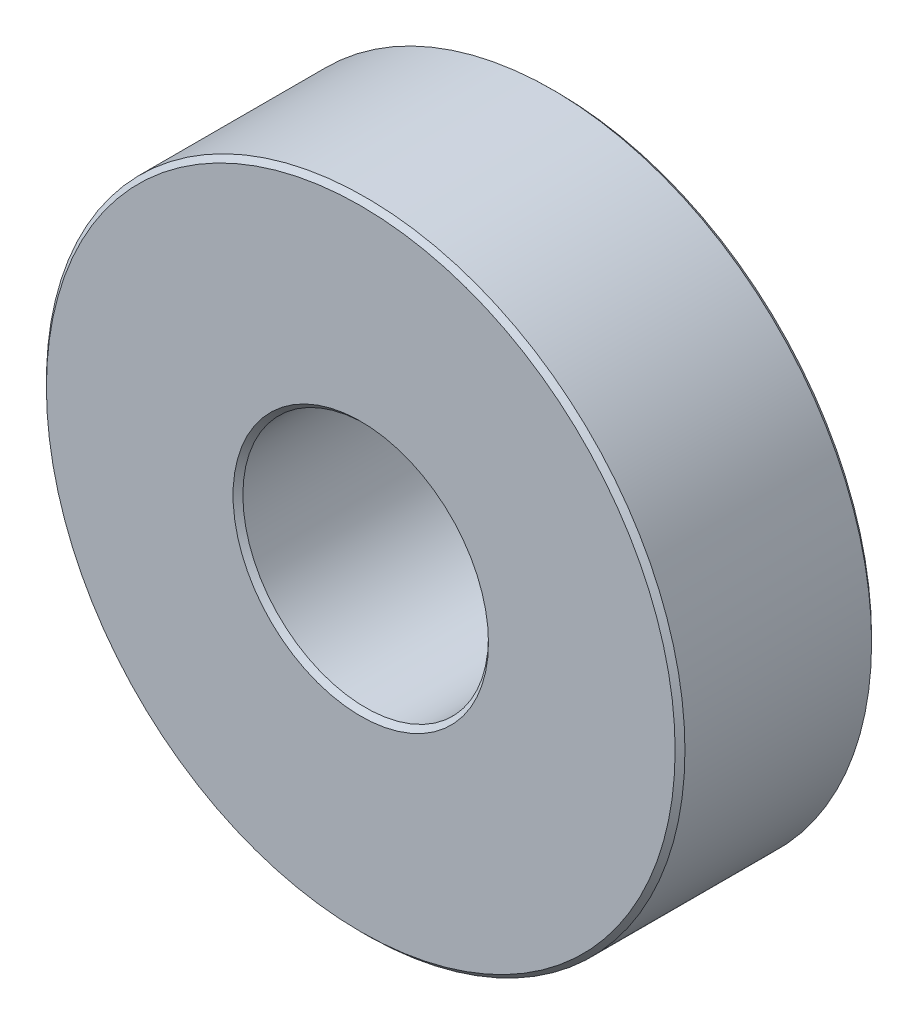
ISO-10303-21;
HEADER;
FILE_DESCRIPTION(('STEP AP214'),'2;1');
FILE_NAME('part.step','',(''),(''),'','','');
FILE_SCHEMA(('AUTOMOTIVE_DESIGN { 1 0 10303 214 1 1 1 1 }'));
ENDSEC;
DATA;
#1=APPLICATION_CONTEXT('core data for automotive mechanical design processes');
#2=APPLICATION_PROTOCOL_DEFINITION('international standard','automotive_design',2000,#1);
#3=PRODUCT_CONTEXT('',#1,'mechanical');
#4=PRODUCT('Part','Part','',(#3));
#5=PRODUCT_RELATED_PRODUCT_CATEGORY('part','',(#4));
#6=PRODUCT_DEFINITION_FORMATION('','',#4);
#7=PRODUCT_DEFINITION_CONTEXT('part definition',#1,'design');
#8=PRODUCT_DEFINITION('design','',#6,#7);
#9=PRODUCT_DEFINITION_SHAPE('','',#8);
#10=(LENGTH_UNIT() NAMED_UNIT(*) SI_UNIT(.MILLI.,.METRE.));
#11=(NAMED_UNIT(*) PLANE_ANGLE_UNIT() SI_UNIT($,.RADIAN.));
#12=(NAMED_UNIT(*) SI_UNIT($,.STERADIAN.) SOLID_ANGLE_UNIT());
#13=UNCERTAINTY_MEASURE_WITH_UNIT(LENGTH_MEASURE(1.E-05),#10,'distance_accuracy_value','');
#14=(GEOMETRIC_REPRESENTATION_CONTEXT(3) GLOBAL_UNCERTAINTY_ASSIGNED_CONTEXT((#13)) GLOBAL_UNIT_ASSIGNED_CONTEXT((#10,
#11,#12)) REPRESENTATION_CONTEXT('',''));
#15=CARTESIAN_POINT('',(0.,0.,0.));
#16=DIRECTION('',(0.,0.,1.));
#17=DIRECTION('',(1.,0.,0.));
#18=AXIS2_PLACEMENT_3D('',#15,#16,#17);
#19=CARTESIAN_POINT('',(0.,0.,4.));
#20=DIRECTION('',(0.,0.,-1.));
#21=DIRECTION('',(-1.,0.,0.));
#22=AXIS2_PLACEMENT_3D('',#19,#20,#21);
#23=CYLINDRICAL_SURFACE('',#22,6.5);
#24=CARTESIAN_POINT('',(0.,0.,3.9));
#25=DIRECTION('',(0.,0.,1.));
#26=DIRECTION('',(1.,0.,0.));
#27=AXIS2_PLACEMENT_3D('',#24,#25,#26);
#28=CIRCLE('',#27,6.5);
#29=CARTESIAN_POINT('',(6.5,0.,3.9));
#30=VERTEX_POINT('',#29);
#31=EDGE_CURVE('E45',#30,#30,#28,.F.);
#32=ORIENTED_EDGE('',*,*,#31,.T.);
#33=EDGE_LOOP('',(#32));
#34=FACE_BOUND('',#33,.T.);
#35=CARTESIAN_POINT('',(0.,0.,0.100000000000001));
#36=DIRECTION('',(0.,0.,1.));
#37=DIRECTION('',(1.,0.,0.));
#38=AXIS2_PLACEMENT_3D('',#35,#36,#37);
#39=CIRCLE('',#38,6.5);
#40=CARTESIAN_POINT('',(6.5,0.,0.100000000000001));
#41=VERTEX_POINT('',#40);
#42=EDGE_CURVE('E48',#41,#41,#39,.T.);
#43=ORIENTED_EDGE('',*,*,#42,.T.);
#44=EDGE_LOOP('',(#43));
#45=FACE_BOUND('',#44,.T.);
#46=ADVANCED_FACE('F26',(#34,#45),#23,.T.);
#47=CARTESIAN_POINT('',(0.,0.,4.));
#48=DIRECTION('',(0.,0.,1.));
#49=DIRECTION('',(1.,0.,0.));
#50=AXIS2_PLACEMENT_3D('',#47,#48,#49);
#51=PLANE('',#50);
#52=CARTESIAN_POINT('',(0.,0.,4.));
#53=DIRECTION('',(0.,0.,1.));
#54=DIRECTION('',(1.,0.,0.));
#55=AXIS2_PLACEMENT_3D('',#52,#53,#54);
#56=CIRCLE('',#55,6.4);
#57=CARTESIAN_POINT('',(6.4,0.,4.));
#58=VERTEX_POINT('',#57);
#59=EDGE_CURVE('E51',#58,#58,#56,.T.);
#60=ORIENTED_EDGE('',*,*,#59,.T.);
#61=EDGE_LOOP('',(#60));
#62=FACE_BOUND('',#61,.T.);
#63=CARTESIAN_POINT('',(0.,0.,4.));
#64=DIRECTION('',(0.,0.,1.));
#65=DIRECTION('',(1.,0.,0.));
#66=AXIS2_PLACEMENT_3D('',#63,#64,#65);
#67=CIRCLE('',#66,2.6);
#68=CARTESIAN_POINT('',(2.6,0.,4.));
#69=VERTEX_POINT('',#68);
#70=EDGE_CURVE('E54',#69,#69,#67,.F.);
#71=ORIENTED_EDGE('',*,*,#70,.T.);
#72=EDGE_LOOP('',(#71));
#73=FACE_BOUND('',#72,.T.);
#74=ADVANCED_FACE('F58',(#62,#73),#51,.T.);
#75=CARTESIAN_POINT('',(0.,0.,0.));
#76=DIRECTION('',(0.,0.,1.));
#77=DIRECTION('',(1.,0.,0.));
#78=AXIS2_PLACEMENT_3D('',#75,#76,#77);
#79=PLANE('',#78);
#80=CARTESIAN_POINT('',(0.,0.,0.));
#81=DIRECTION('',(0.,0.,1.));
#82=DIRECTION('',(1.,0.,0.));
#83=AXIS2_PLACEMENT_3D('',#80,#81,#82);
#84=CIRCLE('',#83,6.4);
#85=CARTESIAN_POINT('',(6.4,0.,0.));
#86=VERTEX_POINT('',#85);
#87=EDGE_CURVE('E36',#86,#86,#84,.F.);
#88=ORIENTED_EDGE('',*,*,#87,.T.);
#89=EDGE_LOOP('',(#88));
#90=FACE_BOUND('',#89,.T.);
#91=CARTESIAN_POINT('',(0.,0.,0.));
#92=DIRECTION('',(0.,0.,1.));
#93=DIRECTION('',(1.,0.,0.));
#94=AXIS2_PLACEMENT_3D('',#91,#92,#93);
#95=CIRCLE('',#94,2.6);
#96=CARTESIAN_POINT('',(2.6,0.,0.));
#97=VERTEX_POINT('',#96);
#98=EDGE_CURVE('E40',#97,#97,#95,.T.);
#99=ORIENTED_EDGE('',*,*,#98,.T.);
#100=EDGE_LOOP('',(#99));
#101=FACE_BOUND('',#100,.T.);
#102=ADVANCED_FACE('F80',(#90,#101),#79,.F.);
#103=CARTESIAN_POINT('',(0.,0.,0.));
#104=DIRECTION('',(0.,0.,1.));
#105=DIRECTION('',(1.,0.,0.));
#106=AXIS2_PLACEMENT_3D('',#103,#104,#105);
#107=CYLINDRICAL_SURFACE('',#106,2.5);
#108=CARTESIAN_POINT('',(0.,0.,3.9));
#109=DIRECTION('',(0.,0.,1.));
#110=DIRECTION('',(1.,0.,0.));
#111=AXIS2_PLACEMENT_3D('',#108,#109,#110);
#112=CIRCLE('',#111,2.5);
#113=CARTESIAN_POINT('',(2.5,0.,3.9));
#114=VERTEX_POINT('',#113);
#115=EDGE_CURVE('E10',#114,#114,#112,.T.);
#116=ORIENTED_EDGE('',*,*,#115,.T.);
#117=EDGE_LOOP('',(#116));
#118=FACE_BOUND('',#117,.T.);
#119=CARTESIAN_POINT('',(0.,0.,0.100000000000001));
#120=DIRECTION('',(0.,0.,1.));
#121=DIRECTION('',(1.,0.,0.));
#122=AXIS2_PLACEMENT_3D('',#119,#120,#121);
#123=CIRCLE('',#122,2.5);
#124=CARTESIAN_POINT('',(2.5,0.,0.100000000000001));
#125=VERTEX_POINT('',#124);
#126=EDGE_CURVE('E32',#125,#125,#123,.F.);
#127=ORIENTED_EDGE('',*,*,#126,.T.);
#128=EDGE_LOOP('',(#127));
#129=FACE_BOUND('',#128,.T.);
#130=ADVANCED_FACE('F89',(#118,#129),#107,.F.);
#131=CARTESIAN_POINT('',(0.,0.,4.));
#132=DIRECTION('',(0.,0.,-1.));
#133=DIRECTION('',(-1.,0.,0.));
#134=AXIS2_PLACEMENT_3D('',#131,#132,#133);
#135=CONICAL_SURFACE('',#134,6.4,0.785398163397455);
#136=ORIENTED_EDGE('',*,*,#31,.F.);
#137=EDGE_LOOP('',(#136));
#138=FACE_BOUND('',#137,.T.);
#139=ORIENTED_EDGE('',*,*,#59,.F.);
#140=EDGE_LOOP('',(#139));
#141=FACE_BOUND('',#140,.T.);
#142=ADVANCED_FACE('F72',(#138,#141),#135,.T.);
#143=CARTESIAN_POINT('',(0.,0.,0.100000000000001));
#144=DIRECTION('',(0.,0.,1.));
#145=DIRECTION('',(1.,0.,0.));
#146=AXIS2_PLACEMENT_3D('',#143,#144,#145);
#147=CONICAL_SURFACE('',#146,6.5,0.785398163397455);
#148=ORIENTED_EDGE('',*,*,#87,.F.);
#149=EDGE_LOOP('',(#148));
#150=FACE_BOUND('',#149,.T.);
#151=ORIENTED_EDGE('',*,*,#42,.F.);
#152=EDGE_LOOP('',(#151));
#153=FACE_BOUND('',#152,.T.);
#154=ADVANCED_FACE('F64',(#150,#153),#147,.T.);
#155=CARTESIAN_POINT('',(0.,0.,3.9));
#156=DIRECTION('',(0.,0.,1.));
#157=DIRECTION('',(1.,0.,0.));
#158=AXIS2_PLACEMENT_3D('',#155,#156,#157);
#159=CONICAL_SURFACE('',#158,2.5,0.785398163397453);
#160=ORIENTED_EDGE('',*,*,#70,.F.);
#161=EDGE_LOOP('',(#160));
#162=FACE_BOUND('',#161,.T.);
#163=ORIENTED_EDGE('',*,*,#115,.F.);
#164=EDGE_LOOP('',(#163));
#165=FACE_BOUND('',#164,.T.);
#166=ADVANCED_FACE('F60',(#162,#165),#159,.F.);
#167=CARTESIAN_POINT('',(0.,0.,0.));
#168=DIRECTION('',(0.,0.,-1.));
#169=DIRECTION('',(-1.,0.,0.));
#170=AXIS2_PLACEMENT_3D('',#167,#168,#169);
#171=CONICAL_SURFACE('',#170,2.6,0.785398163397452);
#172=ORIENTED_EDGE('',*,*,#126,.F.);
#173=EDGE_LOOP('',(#172));
#174=FACE_BOUND('',#173,.T.);
#175=ORIENTED_EDGE('',*,*,#98,.F.);
#176=EDGE_LOOP('',(#175));
#177=FACE_BOUND('',#176,.T.);
#178=ADVANCED_FACE('F63',(#174,#177),#171,.F.);
#179=CLOSED_SHELL('',(#46,#74,#102,#130,#142,#154,#166,#178));
#180=MANIFOLD_SOLID_BREP('B2',#179);
#181=ADVANCED_BREP_SHAPE_REPRESENTATION('',(#18,#180),#14);
#182=SHAPE_DEFINITION_REPRESENTATION(#9,#181);
ENDSEC;
END-ISO-10303-21;
